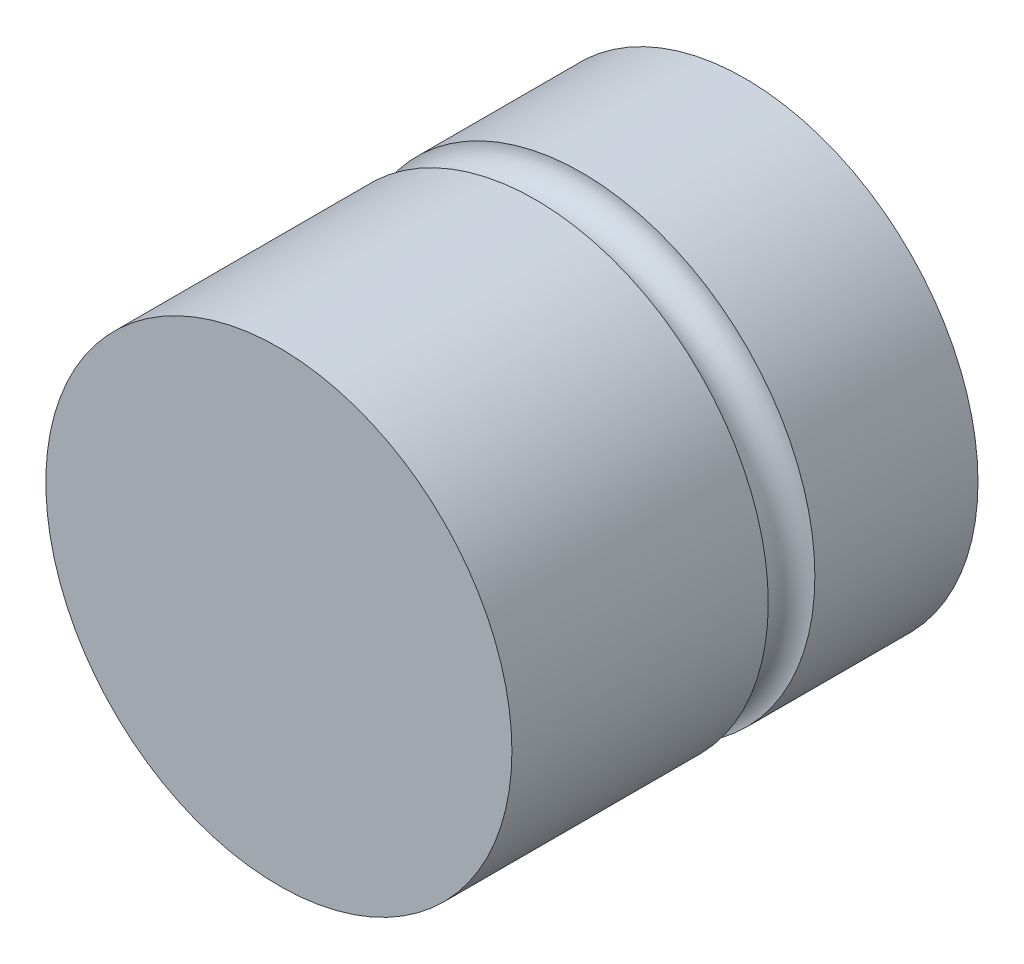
ISO-10303-21;
HEADER;
FILE_DESCRIPTION(('STEP AP214'),'2;1');
FILE_NAME('part.step','',(''),(''),'','','');
FILE_SCHEMA(('AUTOMOTIVE_DESIGN { 1 0 10303 214 1 1 1 1 }'));
ENDSEC;
DATA;
#1=APPLICATION_CONTEXT('core data for automotive mechanical design processes');
#2=APPLICATION_PROTOCOL_DEFINITION('international standard','automotive_design',2000,#1);
#3=PRODUCT_CONTEXT('',#1,'mechanical');
#4=PRODUCT('Part','Part','',(#3));
#5=PRODUCT_RELATED_PRODUCT_CATEGORY('part','',(#4));
#6=PRODUCT_DEFINITION_FORMATION('','',#4);
#7=PRODUCT_DEFINITION_CONTEXT('part definition',#1,'design');
#8=PRODUCT_DEFINITION('design','',#6,#7);
#9=PRODUCT_DEFINITION_SHAPE('','',#8);
#10=(LENGTH_UNIT() NAMED_UNIT(*) SI_UNIT(.MILLI.,.METRE.));
#11=(NAMED_UNIT(*) PLANE_ANGLE_UNIT() SI_UNIT($,.RADIAN.));
#12=(NAMED_UNIT(*) SI_UNIT($,.STERADIAN.) SOLID_ANGLE_UNIT());
#13=UNCERTAINTY_MEASURE_WITH_UNIT(LENGTH_MEASURE(1.E-05),#10,'distance_accuracy_value','');
#14=(GEOMETRIC_REPRESENTATION_CONTEXT(3) GLOBAL_UNCERTAINTY_ASSIGNED_CONTEXT((#13)) GLOBAL_UNIT_ASSIGNED_CONTEXT((#10,
#11,#12)) REPRESENTATION_CONTEXT('',''));
#15=CARTESIAN_POINT('',(0.,0.,0.));
#16=DIRECTION('',(0.,0.,1.));
#17=DIRECTION('',(1.,0.,0.));
#18=AXIS2_PLACEMENT_3D('',#15,#16,#17);
#19=CARTESIAN_POINT('',(0.,0.,100.));
#20=DIRECTION('',(0.,0.,-1.));
#21=DIRECTION('',(-1.,0.,0.));
#22=AXIS2_PLACEMENT_3D('',#19,#20,#21);
#23=CYLINDRICAL_SURFACE('',#22,50.);
#24=CARTESIAN_POINT('',(0.,0.,100.));
#25=DIRECTION('',(0.,0.,1.));
#26=DIRECTION('',(1.,0.,0.));
#27=AXIS2_PLACEMENT_3D('',#24,#25,#26);
#28=CIRCLE('',#27,50.);
#29=CARTESIAN_POINT('',(50.,0.,100.));
#30=VERTEX_POINT('',#29);
#31=EDGE_CURVE('E10',#30,#30,#28,.T.);
#32=ORIENTED_EDGE('',*,*,#31,.F.);
#33=EDGE_LOOP('',(#32));
#34=FACE_BOUND('',#33,.T.);
#35=CARTESIAN_POINT('',(0.,0.,45.));
#36=DIRECTION('',(0.,0.,1.));
#37=DIRECTION('',(1.,0.,0.));
#38=AXIS2_PLACEMENT_3D('',#35,#36,#37);
#39=CIRCLE('',#38,50.);
#40=CARTESIAN_POINT('',(50.,0.,45.));
#41=VERTEX_POINT('',#40);
#42=EDGE_CURVE('E48',#41,#41,#39,.T.);
#43=ORIENTED_EDGE('',*,*,#42,.T.);
#44=EDGE_LOOP('',(#43));
#45=FACE_BOUND('',#44,.T.);
#46=ADVANCED_FACE('F33',(#34,#45),#23,.T.);
#47=CARTESIAN_POINT('',(0.,0.,100.));
#48=DIRECTION('',(0.,0.,1.));
#49=DIRECTION('',(1.,0.,0.));
#50=AXIS2_PLACEMENT_3D('',#47,#48,#49);
#51=PLANE('',#50);
#52=ORIENTED_EDGE('',*,*,#31,.T.);
#53=EDGE_LOOP('',(#52));
#54=FACE_BOUND('',#53,.T.);
#55=ADVANCED_FACE('F56',(#54),#51,.T.);
#56=CARTESIAN_POINT('',(0.,0.,40.));
#57=DIRECTION('',(0.,0.,1.));
#58=DIRECTION('',(1.,0.,0.));
#59=AXIS2_PLACEMENT_3D('',#56,#57,#58);
#60=TOROIDAL_SURFACE('',#59,50.,5.);
#61=CARTESIAN_POINT('',(0.,0.,35.));
#62=DIRECTION('',(0.,0.,1.));
#63=DIRECTION('',(1.,0.,0.));
#64=AXIS2_PLACEMENT_3D('',#61,#62,#63);
#65=CIRCLE('',#64,50.);
#66=CARTESIAN_POINT('',(50.,0.,35.));
#67=VERTEX_POINT('',#66);
#68=EDGE_CURVE('E44',#67,#67,#65,.T.);
#69=ORIENTED_EDGE('',*,*,#68,.T.);
#70=EDGE_LOOP('',(#69));
#71=FACE_BOUND('',#70,.T.);
#72=ORIENTED_EDGE('',*,*,#42,.F.);
#73=EDGE_LOOP('',(#72));
#74=FACE_BOUND('',#73,.T.);
#75=ADVANCED_FACE('F53',(#71,#74),#60,.F.);
#76=CARTESIAN_POINT('',(0.,0.,0.));
#77=DIRECTION('',(0.,0.,1.));
#78=DIRECTION('',(1.,0.,0.));
#79=AXIS2_PLACEMENT_3D('',#76,#77,#78);
#80=PLANE('',#79);
#81=CARTESIAN_POINT('',(0.,0.,0.));
#82=DIRECTION('',(0.,0.,1.));
#83=DIRECTION('',(1.,0.,0.));
#84=AXIS2_PLACEMENT_3D('',#81,#82,#83);
#85=CIRCLE('',#84,50.);
#86=CARTESIAN_POINT('',(50.,0.,0.));
#87=VERTEX_POINT('',#86);
#88=EDGE_CURVE('E36',#87,#87,#85,.T.);
#89=ORIENTED_EDGE('',*,*,#88,.F.);
#90=EDGE_LOOP('',(#89));
#91=FACE_BOUND('',#90,.T.);
#92=ADVANCED_FACE('F55',(#91),#80,.F.);
#93=ORIENTED_EDGE('',*,*,#88,.T.);
#94=EDGE_LOOP('',(#93));
#95=FACE_BOUND('',#94,.T.);
#96=ORIENTED_EDGE('',*,*,#68,.F.);
#97=EDGE_LOOP('',(#96));
#98=FACE_BOUND('',#97,.T.);
#99=ADVANCED_FACE('F63',(#95,#98),#23,.T.);
#100=CLOSED_SHELL('',(#46,#55,#75,#92,#99));
#101=MANIFOLD_SOLID_BREP('B2',#100);
#102=ADVANCED_BREP_SHAPE_REPRESENTATION('',(#18,#101),#14);
#103=SHAPE_DEFINITION_REPRESENTATION(#9,#102);
ENDSEC;
END-ISO-10303-21;
